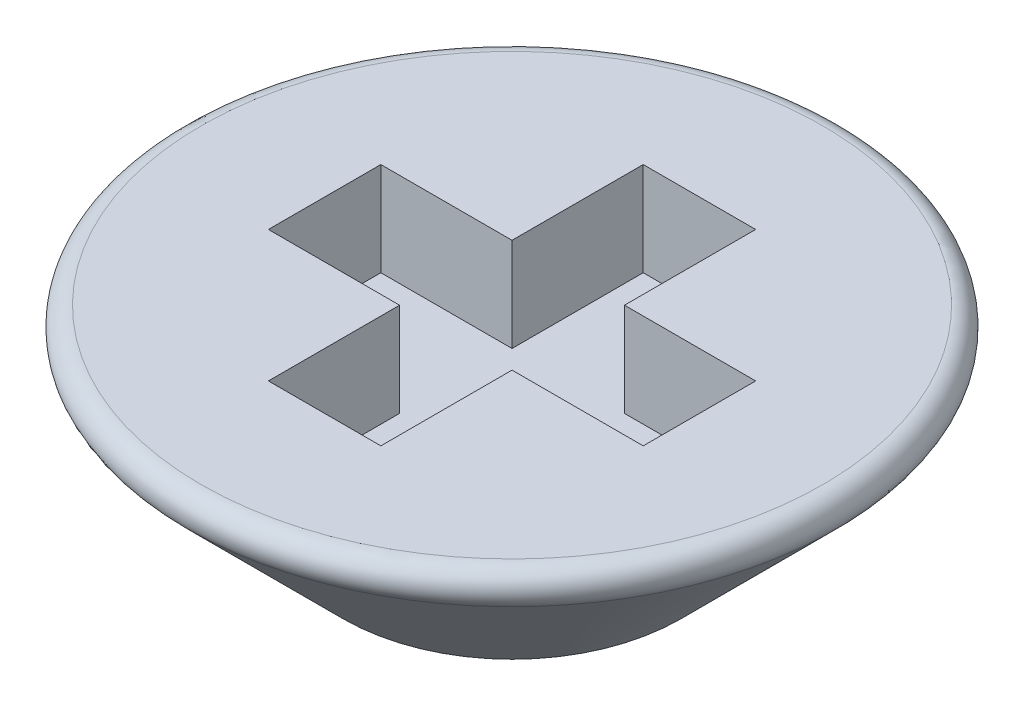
ISO-10303-21;
HEADER;
FILE_DESCRIPTION(('STEP AP214'),'2;1');
FILE_NAME('part.step','',(''),(''),'','','');
FILE_SCHEMA(('AUTOMOTIVE_DESIGN { 1 0 10303 214 1 1 1 1 }'));
ENDSEC;
DATA;
#1=APPLICATION_CONTEXT('core data for automotive mechanical design processes');
#2=APPLICATION_PROTOCOL_DEFINITION('international standard','automotive_design',2000,#1);
#3=PRODUCT_CONTEXT('',#1,'mechanical');
#4=PRODUCT('Part','Part','',(#3));
#5=PRODUCT_RELATED_PRODUCT_CATEGORY('part','',(#4));
#6=PRODUCT_DEFINITION_FORMATION('','',#4);
#7=PRODUCT_DEFINITION_CONTEXT('part definition',#1,'design');
#8=PRODUCT_DEFINITION('design','',#6,#7);
#9=PRODUCT_DEFINITION_SHAPE('','',#8);
#10=(LENGTH_UNIT() NAMED_UNIT(*) SI_UNIT(.MILLI.,.METRE.));
#11=(NAMED_UNIT(*) PLANE_ANGLE_UNIT() SI_UNIT($,.RADIAN.));
#12=(NAMED_UNIT(*) SI_UNIT($,.STERADIAN.) SOLID_ANGLE_UNIT());
#13=UNCERTAINTY_MEASURE_WITH_UNIT(LENGTH_MEASURE(1.E-05),#10,'distance_accuracy_value','');
#14=(GEOMETRIC_REPRESENTATION_CONTEXT(3) GLOBAL_UNCERTAINTY_ASSIGNED_CONTEXT((#13)) GLOBAL_UNIT_ASSIGNED_CONTEXT((#10,
#11,#12)) REPRESENTATION_CONTEXT('',''));
#15=CARTESIAN_POINT('',(0.,0.,0.));
#16=DIRECTION('',(0.,0.,1.));
#17=DIRECTION('',(1.,0.,0.));
#18=AXIS2_PLACEMENT_3D('',#15,#16,#17);
#19=CARTESIAN_POINT('',(-39.4999999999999,49.,-39.5000000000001));
#20=DIRECTION('',(0.,1.,0.));
#21=DIRECTION('',(0.,0.,1.));
#22=AXIS2_PLACEMENT_3D('',#19,#20,#21);
#23=PLANE('',#22);
#24=CARTESIAN_POINT('',(-39.4999999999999,49.,-39.5000000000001));
#25=DIRECTION('',(0.,1.,0.));
#26=DIRECTION('',(0.,0.,1.));
#27=AXIS2_PLACEMENT_3D('',#24,#25,#26);
#28=CIRCLE('',#27,0.900000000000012);
#29=CARTESIAN_POINT('',(-39.4999999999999,49.,-38.6000000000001));
#30=VERTEX_POINT('',#29);
#31=EDGE_CURVE('E188',#30,#30,#28,.F.);
#32=ORIENTED_EDGE('',*,*,#31,.T.);
#33=EDGE_LOOP('',(#32));
#34=FACE_BOUND('',#33,.T.);
#35=ADVANCED_FACE('F32',(#34),#23,.F.);
#36=CARTESIAN_POINT('',(-39.4999999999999,50.,-39.5000000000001));
#37=DIRECTION('',(0.,1.,0.));
#38=DIRECTION('',(0.,0.,1.));
#39=AXIS2_PLACEMENT_3D('',#36,#37,#38);
#40=PLANE('',#39);
#41=CARTESIAN_POINT('',(-39.4999999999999,50.,-39.5000000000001));
#42=DIRECTION('',(0.,1.,0.));
#43=DIRECTION('',(0.,0.,1.));
#44=AXIS2_PLACEMENT_3D('',#41,#42,#43);
#45=CIRCLE('',#44,1.65857864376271);
#46=CARTESIAN_POINT('',(-39.4999999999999,50.,-37.8414213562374));
#47=VERTEX_POINT('',#46);
#48=EDGE_CURVE('E40',#47,#47,#45,.T.);
#49=ORIENTED_EDGE('',*,*,#48,.T.);
#50=EDGE_LOOP('',(#49));
#51=FACE_BOUND('',#50,.T.);
#52=DIRECTION('',(0.,0.,1.));
#53=VECTOR('',#52,1.);
#54=CARTESIAN_POINT('',(-40.4999999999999,50.,-39.2000000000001));
#55=LINE('',#54,#53);
#56=CARTESIAN_POINT('',(-40.4999999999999,50.,-39.8000000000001));
#57=VERTEX_POINT('',#56);
#58=CARTESIAN_POINT('',(-40.4999999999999,50.,-39.2000000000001));
#59=VERTEX_POINT('',#58);
#60=EDGE_CURVE('E47',#57,#59,#55,.T.);
#61=ORIENTED_EDGE('',*,*,#60,.F.);
#62=DIRECTION('',(-1.,0.,0.));
#63=VECTOR('',#62,1.);
#64=CARTESIAN_POINT('',(-40.4999999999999,50.,-39.8000000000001));
#65=LINE('',#64,#63);
#66=CARTESIAN_POINT('',(-39.7999999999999,50.,-39.8000000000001));
#67=VERTEX_POINT('',#66);
#68=EDGE_CURVE('E184',#67,#57,#65,.T.);
#69=ORIENTED_EDGE('',*,*,#68,.F.);
#70=DIRECTION('',(0.,0.,1.));
#71=VECTOR('',#70,1.);
#72=CARTESIAN_POINT('',(-39.7999999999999,50.,-40.5000000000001));
#73=LINE('',#72,#71);
#74=CARTESIAN_POINT('',(-39.7999999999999,50.,-40.5000000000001));
#75=VERTEX_POINT('',#74);
#76=EDGE_CURVE('E182',#75,#67,#73,.T.);
#77=ORIENTED_EDGE('',*,*,#76,.F.);
#78=DIRECTION('',(-1.,0.,0.));
#79=VECTOR('',#78,1.);
#80=CARTESIAN_POINT('',(-39.7999999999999,50.,-40.5000000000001));
#81=LINE('',#80,#79);
#82=CARTESIAN_POINT('',(-39.1999999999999,50.,-40.5000000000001));
#83=VERTEX_POINT('',#82);
#84=EDGE_CURVE('E131',#83,#75,#81,.T.);
#85=ORIENTED_EDGE('',*,*,#84,.F.);
#86=DIRECTION('',(0.,0.,-1.));
#87=VECTOR('',#86,1.);
#88=CARTESIAN_POINT('',(-39.1999999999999,50.,-40.5000000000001));
#89=LINE('',#88,#87);
#90=CARTESIAN_POINT('',(-39.1999999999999,50.,-39.8000000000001));
#91=VERTEX_POINT('',#90);
#92=EDGE_CURVE('E178',#91,#83,#89,.T.);
#93=ORIENTED_EDGE('',*,*,#92,.F.);
#94=DIRECTION('',(-1.,0.,0.));
#95=VECTOR('',#94,1.);
#96=CARTESIAN_POINT('',(-39.1999999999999,50.,-39.8000000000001));
#97=LINE('',#96,#95);
#98=CARTESIAN_POINT('',(-38.4999999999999,50.,-39.8000000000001));
#99=VERTEX_POINT('',#98);
#100=EDGE_CURVE('E175',#99,#91,#97,.T.);
#101=ORIENTED_EDGE('',*,*,#100,.F.);
#102=DIRECTION('',(0.,0.,-1.));
#103=VECTOR('',#102,1.);
#104=CARTESIAN_POINT('',(-38.4999999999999,50.,-39.2000000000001));
#105=LINE('',#104,#103);
#106=CARTESIAN_POINT('',(-38.4999999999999,50.,-39.2000000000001));
#107=VERTEX_POINT('',#106);
#108=EDGE_CURVE('E172',#107,#99,#105,.T.);
#109=ORIENTED_EDGE('',*,*,#108,.F.);
#110=DIRECTION('',(1.,0.,0.));
#111=VECTOR('',#110,1.);
#112=CARTESIAN_POINT('',(-39.1999999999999,50.,-39.2000000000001));
#113=LINE('',#112,#111);
#114=CARTESIAN_POINT('',(-39.1999999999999,50.,-39.2000000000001));
#115=VERTEX_POINT('',#114);
#116=EDGE_CURVE('E169',#115,#107,#113,.T.);
#117=ORIENTED_EDGE('',*,*,#116,.F.);
#118=DIRECTION('',(0.,0.,-1.));
#119=VECTOR('',#118,1.);
#120=CARTESIAN_POINT('',(-39.1999999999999,50.,-39.2000000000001));
#121=LINE('',#120,#119);
#122=CARTESIAN_POINT('',(-39.1999999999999,50.,-38.5000000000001));
#123=VERTEX_POINT('',#122);
#124=EDGE_CURVE('E166',#123,#115,#121,.T.);
#125=ORIENTED_EDGE('',*,*,#124,.F.);
#126=DIRECTION('',(1.,0.,0.));
#127=VECTOR('',#126,1.);
#128=CARTESIAN_POINT('',(-39.7999999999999,50.,-38.5000000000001));
#129=LINE('',#128,#127);
#130=CARTESIAN_POINT('',(-39.7999999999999,50.,-38.5000000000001));
#131=VERTEX_POINT('',#130);
#132=EDGE_CURVE('E163',#131,#123,#129,.T.);
#133=ORIENTED_EDGE('',*,*,#132,.F.);
#134=DIRECTION('',(0.,0.,1.));
#135=VECTOR('',#134,1.);
#136=CARTESIAN_POINT('',(-39.7999999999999,50.,-39.2000000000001));
#137=LINE('',#136,#135);
#138=CARTESIAN_POINT('',(-39.7999999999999,50.,-39.2000000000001));
#139=VERTEX_POINT('',#138);
#140=EDGE_CURVE('E160',#139,#131,#137,.T.);
#141=ORIENTED_EDGE('',*,*,#140,.F.);
#142=DIRECTION('',(1.,0.,0.));
#143=VECTOR('',#142,1.);
#144=CARTESIAN_POINT('',(-40.4999999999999,50.,-39.2000000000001));
#145=LINE('',#144,#143);
#146=EDGE_CURVE('E157',#59,#139,#145,.T.);
#147=ORIENTED_EDGE('',*,*,#146,.F.);
#148=EDGE_LOOP('',(#61,#69,#77,#85,#93,#101,#109,#117,#125,#133,#141,#147));
#149=FACE_BOUND('',#148,.T.);
#150=ADVANCED_FACE('F210',(#51,#149),#40,.T.);
#151=CARTESIAN_POINT('',(-39.4999999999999,50.,-39.5000000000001));
#152=DIRECTION('',(0.,1.,0.));
#153=DIRECTION('',(0.,0.,1.));
#154=AXIS2_PLACEMENT_3D('',#151,#152,#153);
#155=CONICAL_SURFACE('',#154,1.90000000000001,0.78539816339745);
#156=CARTESIAN_POINT('',(-39.4999999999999,49.8292893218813,-39.5000000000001));
#157=DIRECTION('',(0.,-1.,0.));
#158=DIRECTION('',(0.,0.,-1.));
#159=AXIS2_PLACEMENT_3D('',#156,#157,#158);
#160=CIRCLE('',#159,1.72928932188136);
#161=CARTESIAN_POINT('',(-39.4999999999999,49.8292893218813,-41.2292893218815));
#162=VERTEX_POINT('',#161);
#163=EDGE_CURVE('E11',#162,#162,#160,.T.);
#164=ORIENTED_EDGE('',*,*,#163,.T.);
#165=EDGE_LOOP('',(#164));
#166=FACE_BOUND('',#165,.T.);
#167=ORIENTED_EDGE('',*,*,#31,.F.);
#168=EDGE_LOOP('',(#167));
#169=FACE_BOUND('',#168,.T.);
#170=ADVANCED_FACE('F227',(#166,#169),#155,.T.);
#171=CARTESIAN_POINT('',(-40.4999999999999,49.5,-39.2000000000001));
#172=DIRECTION('',(-1.,0.,0.));
#173=DIRECTION('',(0.,0.,1.));
#174=AXIS2_PLACEMENT_3D('',#171,#172,#173);
#175=PLANE('',#174);
#176=ORIENTED_EDGE('',*,*,#60,.T.);
#177=DIRECTION('',(0.,1.,0.));
#178=VECTOR('',#177,1.);
#179=CARTESIAN_POINT('',(-40.4999999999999,49.5,-39.2000000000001));
#180=LINE('',#179,#178);
#181=CARTESIAN_POINT('',(-40.4999999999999,49.5,-39.2000000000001));
#182=VERTEX_POINT('',#181);
#183=EDGE_CURVE('E95',#182,#59,#180,.T.);
#184=ORIENTED_EDGE('',*,*,#183,.F.);
#185=DIRECTION('',(0.,0.,1.));
#186=VECTOR('',#185,1.);
#187=CARTESIAN_POINT('',(-40.4999999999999,49.5,-39.2000000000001));
#188=LINE('',#187,#186);
#189=CARTESIAN_POINT('',(-40.4999999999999,49.5,-39.8000000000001));
#190=VERTEX_POINT('',#189);
#191=EDGE_CURVE('E186',#190,#182,#188,.T.);
#192=ORIENTED_EDGE('',*,*,#191,.F.);
#193=DIRECTION('',(0.,1.,0.));
#194=VECTOR('',#193,1.);
#195=CARTESIAN_POINT('',(-40.4999999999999,49.5,-39.8000000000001));
#196=LINE('',#195,#194);
#197=EDGE_CURVE('E55',#190,#57,#196,.T.);
#198=ORIENTED_EDGE('',*,*,#197,.T.);
#199=EDGE_LOOP('',(#176,#184,#192,#198));
#200=FACE_BOUND('',#199,.T.);
#201=ADVANCED_FACE('F230',(#200),#175,.F.);
#202=CARTESIAN_POINT('',(-40.4999999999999,49.5,-39.8000000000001));
#203=DIRECTION('',(0.,0.,-1.));
#204=DIRECTION('',(-1.,0.,0.));
#205=AXIS2_PLACEMENT_3D('',#202,#203,#204);
#206=PLANE('',#205);
#207=ORIENTED_EDGE('',*,*,#68,.T.);
#208=ORIENTED_EDGE('',*,*,#197,.F.);
#209=DIRECTION('',(-1.,0.,0.));
#210=VECTOR('',#209,1.);
#211=CARTESIAN_POINT('',(-40.4999999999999,49.5,-39.8000000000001));
#212=LINE('',#211,#210);
#213=CARTESIAN_POINT('',(-39.7999999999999,49.5,-39.8000000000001));
#214=VERTEX_POINT('',#213);
#215=EDGE_CURVE('E143',#214,#190,#212,.T.);
#216=ORIENTED_EDGE('',*,*,#215,.F.);
#217=DIRECTION('',(0.,1.,0.));
#218=VECTOR('',#217,1.);
#219=CARTESIAN_POINT('',(-39.7999999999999,49.5,-39.8000000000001));
#220=LINE('',#219,#218);
#221=EDGE_CURVE('E135',#214,#67,#220,.T.);
#222=ORIENTED_EDGE('',*,*,#221,.T.);
#223=EDGE_LOOP('',(#207,#208,#216,#222));
#224=FACE_BOUND('',#223,.T.);
#225=ADVANCED_FACE('F237',(#224),#206,.F.);
#226=CARTESIAN_POINT('',(-39.7999999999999,49.5,-40.5000000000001));
#227=DIRECTION('',(-1.,0.,0.));
#228=DIRECTION('',(0.,0.,1.));
#229=AXIS2_PLACEMENT_3D('',#226,#227,#228);
#230=PLANE('',#229);
#231=ORIENTED_EDGE('',*,*,#76,.T.);
#232=ORIENTED_EDGE('',*,*,#221,.F.);
#233=DIRECTION('',(0.,0.,1.));
#234=VECTOR('',#233,1.);
#235=CARTESIAN_POINT('',(-39.7999999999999,49.5,-40.5000000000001));
#236=LINE('',#235,#234);
#237=CARTESIAN_POINT('',(-39.7999999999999,49.5,-40.5000000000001));
#238=VERTEX_POINT('',#237);
#239=EDGE_CURVE('E139',#238,#214,#236,.T.);
#240=ORIENTED_EDGE('',*,*,#239,.F.);
#241=DIRECTION('',(0.,1.,0.));
#242=VECTOR('',#241,1.);
#243=CARTESIAN_POINT('',(-39.7999999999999,49.5,-40.5000000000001));
#244=LINE('',#243,#242);
#245=EDGE_CURVE('E124',#238,#75,#244,.T.);
#246=ORIENTED_EDGE('',*,*,#245,.T.);
#247=EDGE_LOOP('',(#231,#232,#240,#246));
#248=FACE_BOUND('',#247,.T.);
#249=ADVANCED_FACE('F140',(#248),#230,.F.);
#250=CARTESIAN_POINT('',(-39.7999999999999,49.5,-40.5000000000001));
#251=DIRECTION('',(0.,0.,-1.));
#252=DIRECTION('',(-1.,0.,0.));
#253=AXIS2_PLACEMENT_3D('',#250,#251,#252);
#254=PLANE('',#253);
#255=ORIENTED_EDGE('',*,*,#84,.T.);
#256=ORIENTED_EDGE('',*,*,#245,.F.);
#257=DIRECTION('',(-1.,0.,0.));
#258=VECTOR('',#257,1.);
#259=CARTESIAN_POINT('',(-39.7999999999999,49.5,-40.5000000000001));
#260=LINE('',#259,#258);
#261=CARTESIAN_POINT('',(-39.1999999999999,49.5,-40.5000000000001));
#262=VERTEX_POINT('',#261);
#263=EDGE_CURVE('E128',#262,#238,#260,.T.);
#264=ORIENTED_EDGE('',*,*,#263,.F.);
#265=DIRECTION('',(0.,1.,0.));
#266=VECTOR('',#265,1.);
#267=CARTESIAN_POINT('',(-39.1999999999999,49.5,-40.5000000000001));
#268=LINE('',#267,#266);
#269=EDGE_CURVE('E136',#262,#83,#268,.T.);
#270=ORIENTED_EDGE('',*,*,#269,.T.);
#271=EDGE_LOOP('',(#255,#256,#264,#270));
#272=FACE_BOUND('',#271,.T.);
#273=ADVANCED_FACE('F126',(#272),#254,.F.);
#274=CARTESIAN_POINT('',(-39.1999999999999,49.5,-40.5000000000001));
#275=DIRECTION('',(1.,0.,0.));
#276=DIRECTION('',(0.,0.,-1.));
#277=AXIS2_PLACEMENT_3D('',#274,#275,#276);
#278=PLANE('',#277);
#279=ORIENTED_EDGE('',*,*,#92,.T.);
#280=ORIENTED_EDGE('',*,*,#269,.F.);
#281=DIRECTION('',(0.,0.,-1.));
#282=VECTOR('',#281,1.);
#283=CARTESIAN_POINT('',(-39.1999999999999,49.5,-40.5000000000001));
#284=LINE('',#283,#282);
#285=CARTESIAN_POINT('',(-39.1999999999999,49.5,-39.8000000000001));
#286=VERTEX_POINT('',#285);
#287=EDGE_CURVE('E149',#286,#262,#284,.T.);
#288=ORIENTED_EDGE('',*,*,#287,.F.);
#289=DIRECTION('',(0.,1.,0.));
#290=VECTOR('',#289,1.);
#291=CARTESIAN_POINT('',(-39.1999999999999,49.5,-39.8000000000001));
#292=LINE('',#291,#290);
#293=EDGE_CURVE('E191',#286,#91,#292,.T.);
#294=ORIENTED_EDGE('',*,*,#293,.T.);
#295=EDGE_LOOP('',(#279,#280,#288,#294));
#296=FACE_BOUND('',#295,.T.);
#297=ADVANCED_FACE('F251',(#296),#278,.F.);
#298=CARTESIAN_POINT('',(-39.1999999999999,49.5,-39.8000000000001));
#299=DIRECTION('',(0.,0.,-1.));
#300=DIRECTION('',(-1.,0.,0.));
#301=AXIS2_PLACEMENT_3D('',#298,#299,#300);
#302=PLANE('',#301);
#303=ORIENTED_EDGE('',*,*,#100,.T.);
#304=ORIENTED_EDGE('',*,*,#293,.F.);
#305=DIRECTION('',(-1.,0.,0.));
#306=VECTOR('',#305,1.);
#307=CARTESIAN_POINT('',(-39.1999999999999,49.5,-39.8000000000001));
#308=LINE('',#307,#306);
#309=CARTESIAN_POINT('',(-38.4999999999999,49.5,-39.8000000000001));
#310=VERTEX_POINT('',#309);
#311=EDGE_CURVE('E151',#310,#286,#308,.T.);
#312=ORIENTED_EDGE('',*,*,#311,.F.);
#313=DIRECTION('',(0.,1.,0.));
#314=VECTOR('',#313,1.);
#315=CARTESIAN_POINT('',(-38.4999999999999,49.5,-39.8000000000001));
#316=LINE('',#315,#314);
#317=EDGE_CURVE('E193',#310,#99,#316,.T.);
#318=ORIENTED_EDGE('',*,*,#317,.T.);
#319=EDGE_LOOP('',(#303,#304,#312,#318));
#320=FACE_BOUND('',#319,.T.);
#321=ADVANCED_FACE('F254',(#320),#302,.F.);
#322=CARTESIAN_POINT('',(-38.4999999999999,49.5,-39.2000000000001));
#323=DIRECTION('',(1.,0.,0.));
#324=DIRECTION('',(0.,0.,-1.));
#325=AXIS2_PLACEMENT_3D('',#322,#323,#324);
#326=PLANE('',#325);
#327=ORIENTED_EDGE('',*,*,#108,.T.);
#328=ORIENTED_EDGE('',*,*,#317,.F.);
#329=DIRECTION('',(0.,0.,-1.));
#330=VECTOR('',#329,1.);
#331=CARTESIAN_POINT('',(-38.4999999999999,49.5,-39.2000000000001));
#332=LINE('',#331,#330);
#333=CARTESIAN_POINT('',(-38.4999999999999,49.5,-39.2000000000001));
#334=VERTEX_POINT('',#333);
#335=EDGE_CURVE('E305',#334,#310,#332,.T.);
#336=ORIENTED_EDGE('',*,*,#335,.F.);
#337=DIRECTION('',(0.,1.,0.));
#338=VECTOR('',#337,1.);
#339=CARTESIAN_POINT('',(-38.4999999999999,49.5,-39.2000000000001));
#340=LINE('',#339,#338);
#341=EDGE_CURVE('E195',#334,#107,#340,.T.);
#342=ORIENTED_EDGE('',*,*,#341,.T.);
#343=EDGE_LOOP('',(#327,#328,#336,#342));
#344=FACE_BOUND('',#343,.T.);
#345=ADVANCED_FACE('F258',(#344),#326,.F.);
#346=CARTESIAN_POINT('',(-39.1999999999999,49.5,-39.2000000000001));
#347=DIRECTION('',(0.,0.,1.));
#348=DIRECTION('',(1.,0.,0.));
#349=AXIS2_PLACEMENT_3D('',#346,#347,#348);
#350=PLANE('',#349);
#351=ORIENTED_EDGE('',*,*,#116,.T.);
#352=ORIENTED_EDGE('',*,*,#341,.F.);
#353=DIRECTION('',(1.,0.,0.));
#354=VECTOR('',#353,1.);
#355=CARTESIAN_POINT('',(-39.1999999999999,49.5,-39.2000000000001));
#356=LINE('',#355,#354);
#357=CARTESIAN_POINT('',(-39.1999999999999,49.5,-39.2000000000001));
#358=VERTEX_POINT('',#357);
#359=EDGE_CURVE('E302',#358,#334,#356,.T.);
#360=ORIENTED_EDGE('',*,*,#359,.F.);
#361=DIRECTION('',(0.,1.,0.));
#362=VECTOR('',#361,1.);
#363=CARTESIAN_POINT('',(-39.1999999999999,49.5,-39.2000000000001));
#364=LINE('',#363,#362);
#365=EDGE_CURVE('E197',#358,#115,#364,.T.);
#366=ORIENTED_EDGE('',*,*,#365,.T.);
#367=EDGE_LOOP('',(#351,#352,#360,#366));
#368=FACE_BOUND('',#367,.T.);
#369=ADVANCED_FACE('F262',(#368),#350,.F.);
#370=CARTESIAN_POINT('',(-39.1999999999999,49.5,-39.2000000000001));
#371=DIRECTION('',(1.,0.,0.));
#372=DIRECTION('',(0.,0.,-1.));
#373=AXIS2_PLACEMENT_3D('',#370,#371,#372);
#374=PLANE('',#373);
#375=ORIENTED_EDGE('',*,*,#124,.T.);
#376=ORIENTED_EDGE('',*,*,#365,.F.);
#377=DIRECTION('',(0.,0.,-1.));
#378=VECTOR('',#377,1.);
#379=CARTESIAN_POINT('',(-39.1999999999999,49.5,-39.2000000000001));
#380=LINE('',#379,#378);
#381=CARTESIAN_POINT('',(-39.1999999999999,49.5,-38.5000000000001));
#382=VERTEX_POINT('',#381);
#383=EDGE_CURVE('E299',#382,#358,#380,.T.);
#384=ORIENTED_EDGE('',*,*,#383,.F.);
#385=DIRECTION('',(0.,1.,0.));
#386=VECTOR('',#385,1.);
#387=CARTESIAN_POINT('',(-39.1999999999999,49.5,-38.5000000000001));
#388=LINE('',#387,#386);
#389=EDGE_CURVE('E199',#382,#123,#388,.T.);
#390=ORIENTED_EDGE('',*,*,#389,.T.);
#391=EDGE_LOOP('',(#375,#376,#384,#390));
#392=FACE_BOUND('',#391,.T.);
#393=ADVANCED_FACE('F266',(#392),#374,.F.);
#394=CARTESIAN_POINT('',(-39.7999999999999,49.5,-38.5000000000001));
#395=DIRECTION('',(0.,0.,1.));
#396=DIRECTION('',(1.,0.,0.));
#397=AXIS2_PLACEMENT_3D('',#394,#395,#396);
#398=PLANE('',#397);
#399=ORIENTED_EDGE('',*,*,#132,.T.);
#400=ORIENTED_EDGE('',*,*,#389,.F.);
#401=DIRECTION('',(1.,0.,0.));
#402=VECTOR('',#401,1.);
#403=CARTESIAN_POINT('',(-39.7999999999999,49.5,-38.5000000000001));
#404=LINE('',#403,#402);
#405=CARTESIAN_POINT('',(-39.7999999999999,49.5,-38.5000000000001));
#406=VERTEX_POINT('',#405);
#407=EDGE_CURVE('E292',#406,#382,#404,.T.);
#408=ORIENTED_EDGE('',*,*,#407,.F.);
#409=DIRECTION('',(0.,1.,0.));
#410=VECTOR('',#409,1.);
#411=CARTESIAN_POINT('',(-39.7999999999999,49.5,-38.5000000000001));
#412=LINE('',#411,#410);
#413=EDGE_CURVE('E201',#406,#131,#412,.T.);
#414=ORIENTED_EDGE('',*,*,#413,.T.);
#415=EDGE_LOOP('',(#399,#400,#408,#414));
#416=FACE_BOUND('',#415,.T.);
#417=ADVANCED_FACE('F270',(#416),#398,.F.);
#418=CARTESIAN_POINT('',(-39.7999999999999,49.5,-39.2000000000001));
#419=DIRECTION('',(-1.,0.,0.));
#420=DIRECTION('',(0.,0.,1.));
#421=AXIS2_PLACEMENT_3D('',#418,#419,#420);
#422=PLANE('',#421);
#423=ORIENTED_EDGE('',*,*,#140,.T.);
#424=ORIENTED_EDGE('',*,*,#413,.F.);
#425=DIRECTION('',(0.,0.,1.));
#426=VECTOR('',#425,1.);
#427=CARTESIAN_POINT('',(-39.7999999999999,49.5,-39.2000000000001));
#428=LINE('',#427,#426);
#429=CARTESIAN_POINT('',(-39.7999999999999,49.5,-39.2000000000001));
#430=VERTEX_POINT('',#429);
#431=EDGE_CURVE('E289',#430,#406,#428,.T.);
#432=ORIENTED_EDGE('',*,*,#431,.F.);
#433=DIRECTION('',(0.,1.,0.));
#434=VECTOR('',#433,1.);
#435=CARTESIAN_POINT('',(-39.7999999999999,49.5,-39.2000000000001));
#436=LINE('',#435,#434);
#437=EDGE_CURVE('E203',#430,#139,#436,.T.);
#438=ORIENTED_EDGE('',*,*,#437,.T.);
#439=EDGE_LOOP('',(#423,#424,#432,#438));
#440=FACE_BOUND('',#439,.T.);
#441=ADVANCED_FACE('F274',(#440),#422,.F.);
#442=CARTESIAN_POINT('',(-40.4999999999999,49.5,-39.2000000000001));
#443=DIRECTION('',(0.,0.,1.));
#444=DIRECTION('',(1.,0.,0.));
#445=AXIS2_PLACEMENT_3D('',#442,#443,#444);
#446=PLANE('',#445);
#447=ORIENTED_EDGE('',*,*,#146,.T.);
#448=ORIENTED_EDGE('',*,*,#437,.F.);
#449=DIRECTION('',(1.,0.,0.));
#450=VECTOR('',#449,1.);
#451=CARTESIAN_POINT('',(-40.4999999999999,49.5,-39.2000000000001));
#452=LINE('',#451,#450);
#453=EDGE_CURVE('E293',#182,#430,#452,.T.);
#454=ORIENTED_EDGE('',*,*,#453,.F.);
#455=ORIENTED_EDGE('',*,*,#183,.T.);
#456=EDGE_LOOP('',(#447,#448,#454,#455));
#457=FACE_BOUND('',#456,.T.);
#458=ADVANCED_FACE('F218',(#457),#446,.F.);
#459=CARTESIAN_POINT('',(0.,49.5,0.));
#460=DIRECTION('',(0.,-1.,0.));
#461=DIRECTION('',(0.,0.,-1.));
#462=AXIS2_PLACEMENT_3D('',#459,#460,#461);
#463=PLANE('',#462);
#464=ORIENTED_EDGE('',*,*,#191,.T.);
#465=ORIENTED_EDGE('',*,*,#453,.T.);
#466=ORIENTED_EDGE('',*,*,#431,.T.);
#467=ORIENTED_EDGE('',*,*,#407,.T.);
#468=ORIENTED_EDGE('',*,*,#383,.T.);
#469=ORIENTED_EDGE('',*,*,#359,.T.);
#470=ORIENTED_EDGE('',*,*,#335,.T.);
#471=ORIENTED_EDGE('',*,*,#311,.T.);
#472=ORIENTED_EDGE('',*,*,#287,.T.);
#473=ORIENTED_EDGE('',*,*,#263,.T.);
#474=ORIENTED_EDGE('',*,*,#239,.T.);
#475=ORIENTED_EDGE('',*,*,#215,.T.);
#476=EDGE_LOOP('',(#464,#465,#466,#467,#468,#469,#470,#471,#472,#473,#474,#475));
#477=FACE_BOUND('',#476,.T.);
#478=ADVANCED_FACE('F146',(#477),#463,.F.);
#479=CARTESIAN_POINT('',(-39.4999999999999,49.9,-39.5000000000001));
#480=DIRECTION('',(0.,1.,0.));
#481=DIRECTION('',(0.,0.,1.));
#482=AXIS2_PLACEMENT_3D('',#479,#480,#481);
#483=TOROIDAL_SURFACE('',#482,1.65857864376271,0.1);
#484=ORIENTED_EDGE('',*,*,#163,.F.);
#485=EDGE_LOOP('',(#484));
#486=FACE_BOUND('',#485,.T.);
#487=ORIENTED_EDGE('',*,*,#48,.F.);
#488=EDGE_LOOP('',(#487));
#489=FACE_BOUND('',#488,.T.);
#490=ADVANCED_FACE('F34',(#486,#489),#483,.T.);
#491=CLOSED_SHELL('',(#35,#150,#170,#201,#225,#249,#273,#297,#321,#345,#369,#393,#417,#441,#458,
#478,#490));
#492=MANIFOLD_SOLID_BREP('B2',#491);
#493=ADVANCED_BREP_SHAPE_REPRESENTATION('',(#18,#492),#14);
#494=SHAPE_DEFINITION_REPRESENTATION(#9,#493);
ENDSEC;
END-ISO-10303-21;
